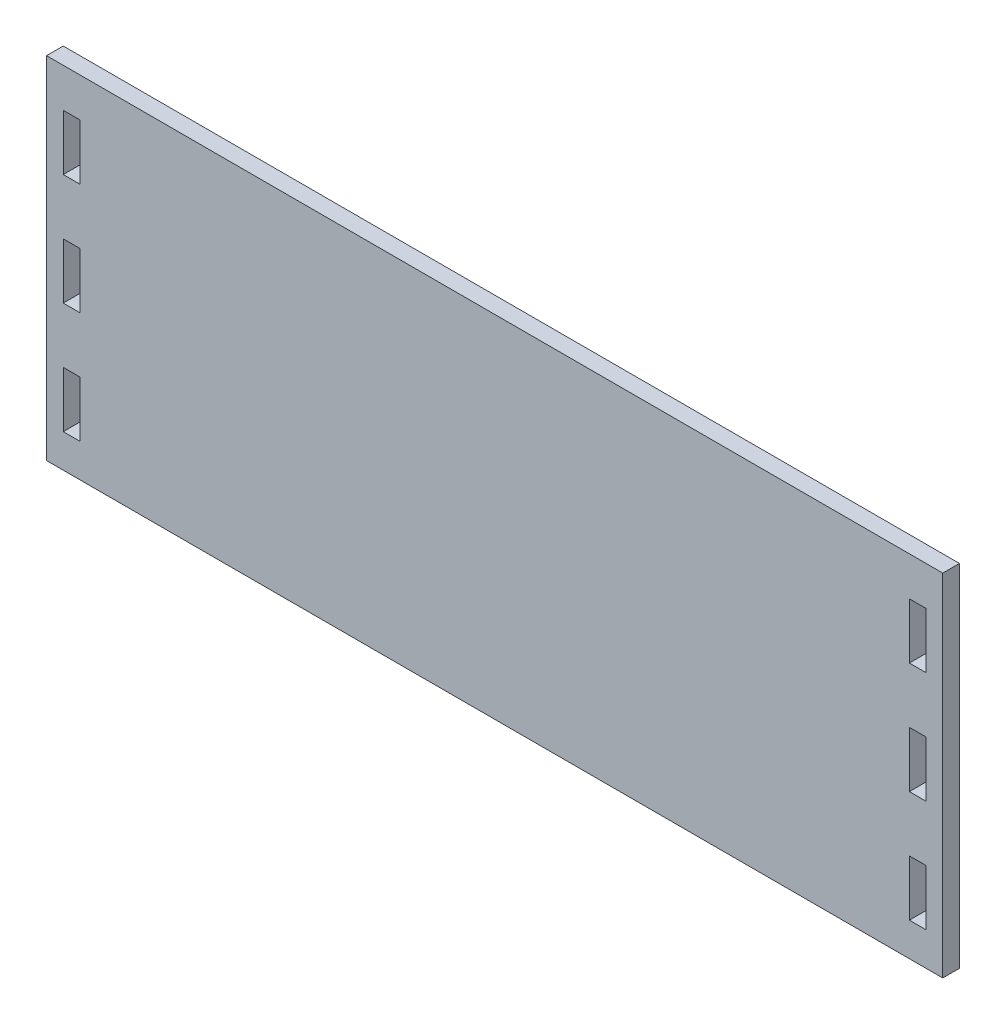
ISO-10303-21;
HEADER;
FILE_DESCRIPTION(('STEP AP214'),'2;1');
FILE_NAME('part.step','',(''),(''),'','','');
FILE_SCHEMA(('AUTOMOTIVE_DESIGN { 1 0 10303 214 1 1 1 1 }'));
ENDSEC;
DATA;
#1=APPLICATION_CONTEXT('core data for automotive mechanical design processes');
#2=APPLICATION_PROTOCOL_DEFINITION('international standard','automotive_design',2000,#1);
#3=PRODUCT_CONTEXT('',#1,'mechanical');
#4=PRODUCT('Part','Part','',(#3));
#5=PRODUCT_RELATED_PRODUCT_CATEGORY('part','',(#4));
#6=PRODUCT_DEFINITION_FORMATION('','',#4);
#7=PRODUCT_DEFINITION_CONTEXT('part definition',#1,'design');
#8=PRODUCT_DEFINITION('design','',#6,#7);
#9=PRODUCT_DEFINITION_SHAPE('','',#8);
#10=(LENGTH_UNIT() NAMED_UNIT(*) SI_UNIT(.MILLI.,.METRE.));
#11=(NAMED_UNIT(*) PLANE_ANGLE_UNIT() SI_UNIT($,.RADIAN.));
#12=(NAMED_UNIT(*) SI_UNIT($,.STERADIAN.) SOLID_ANGLE_UNIT());
#13=UNCERTAINTY_MEASURE_WITH_UNIT(LENGTH_MEASURE(1.E-05),#10,'distance_accuracy_value','');
#14=(GEOMETRIC_REPRESENTATION_CONTEXT(3) GLOBAL_UNCERTAINTY_ASSIGNED_CONTEXT((#13)) GLOBAL_UNIT_ASSIGNED_CONTEXT((#10,
#11,#12)) REPRESENTATION_CONTEXT('',''));
#15=CARTESIAN_POINT('',(0.,0.,0.));
#16=DIRECTION('',(0.,0.,1.));
#17=DIRECTION('',(1.,0.,0.));
#18=AXIS2_PLACEMENT_3D('',#15,#16,#17);
#19=CARTESIAN_POINT('',(0.,0.,3.));
#20=DIRECTION('',(0.,0.,1.));
#21=DIRECTION('',(1.,0.,0.));
#22=AXIS2_PLACEMENT_3D('',#19,#20,#21);
#23=PLANE('',#22);
#24=DIRECTION('',(0.,1.,0.));
#25=VECTOR('',#24,1.);
#26=CARTESIAN_POINT('',(80.5,31.5,3.));
#27=LINE('',#26,#25);
#28=CARTESIAN_POINT('',(80.5,-31.5,3.));
#29=VERTEX_POINT('',#28);
#30=CARTESIAN_POINT('',(80.5,31.5,3.));
#31=VERTEX_POINT('',#30);
#32=EDGE_CURVE('E409',#29,#31,#27,.T.);
#33=ORIENTED_EDGE('',*,*,#32,.T.);
#34=DIRECTION('',(-1.,0.,0.));
#35=VECTOR('',#34,1.);
#36=CARTESIAN_POINT('',(-80.5,31.5,3.));
#37=LINE('',#36,#35);
#38=CARTESIAN_POINT('',(-80.5,31.5,3.));
#39=VERTEX_POINT('',#38);
#40=EDGE_CURVE('E412',#31,#39,#37,.T.);
#41=ORIENTED_EDGE('',*,*,#40,.T.);
#42=DIRECTION('',(0.,-1.,0.));
#43=VECTOR('',#42,1.);
#44=CARTESIAN_POINT('',(-80.5,31.5,3.));
#45=LINE('',#44,#43);
#46=CARTESIAN_POINT('',(-80.5,-31.5,3.));
#47=VERTEX_POINT('',#46);
#48=EDGE_CURVE('E415',#39,#47,#45,.T.);
#49=ORIENTED_EDGE('',*,*,#48,.T.);
#50=DIRECTION('',(1.,0.,0.));
#51=VECTOR('',#50,1.);
#52=CARTESIAN_POINT('',(-80.5,-31.5,3.));
#53=LINE('',#52,#51);
#54=EDGE_CURVE('E417',#47,#29,#53,.T.);
#55=ORIENTED_EDGE('',*,*,#54,.T.);
#56=EDGE_LOOP('',(#33,#41,#49,#55));
#57=FACE_BOUND('',#56,.T.);
#58=DIRECTION('',(1.,0.,0.));
#59=VECTOR('',#58,1.);
#60=CARTESIAN_POINT('',(77.5000000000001,-25.5,3.));
#61=LINE('',#60,#59);
#62=CARTESIAN_POINT('',(74.5,-25.5,3.));
#63=VERTEX_POINT('',#62);
#64=CARTESIAN_POINT('',(77.5000000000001,-25.5,3.));
#65=VERTEX_POINT('',#64);
#66=EDGE_CURVE('E380',#63,#65,#61,.T.);
#67=ORIENTED_EDGE('',*,*,#66,.F.);
#68=DIRECTION('',(0.,-1.,0.));
#69=VECTOR('',#68,1.);
#70=CARTESIAN_POINT('',(74.5,-25.5,3.));
#71=LINE('',#70,#69);
#72=CARTESIAN_POINT('',(74.5,-15.5,3.));
#73=VERTEX_POINT('',#72);
#74=EDGE_CURVE('E378',#73,#63,#71,.T.);
#75=ORIENTED_EDGE('',*,*,#74,.F.);
#76=DIRECTION('',(-1.,0.,0.));
#77=VECTOR('',#76,1.);
#78=CARTESIAN_POINT('',(77.5,-15.5,3.));
#79=LINE('',#78,#77);
#80=CARTESIAN_POINT('',(77.5,-15.5,3.));
#81=VERTEX_POINT('',#80);
#82=EDGE_CURVE('E386',#81,#73,#79,.T.);
#83=ORIENTED_EDGE('',*,*,#82,.F.);
#84=DIRECTION('',(0.,1.,0.));
#85=VECTOR('',#84,1.);
#86=CARTESIAN_POINT('',(77.5000000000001,-25.5,3.));
#87=LINE('',#86,#85);
#88=EDGE_CURVE('E383',#65,#81,#87,.T.);
#89=ORIENTED_EDGE('',*,*,#88,.F.);
#90=EDGE_LOOP('',(#67,#75,#83,#89));
#91=FACE_BOUND('',#90,.T.);
#92=DIRECTION('',(-1.,0.,0.));
#93=VECTOR('',#92,1.);
#94=CARTESIAN_POINT('',(-77.5,-15.5,3.));
#95=LINE('',#94,#93);
#96=CARTESIAN_POINT('',(-74.5,-15.5,3.));
#97=VERTEX_POINT('',#96);
#98=CARTESIAN_POINT('',(-77.5,-15.5,3.));
#99=VERTEX_POINT('',#98);
#100=EDGE_CURVE('E349',#97,#99,#95,.T.);
#101=ORIENTED_EDGE('',*,*,#100,.F.);
#102=DIRECTION('',(0.,1.,0.));
#103=VECTOR('',#102,1.);
#104=CARTESIAN_POINT('',(-74.5,-25.5,3.));
#105=LINE('',#104,#103);
#106=CARTESIAN_POINT('',(-74.5,-25.5,3.));
#107=VERTEX_POINT('',#106);
#108=EDGE_CURVE('E347',#107,#97,#105,.T.);
#109=ORIENTED_EDGE('',*,*,#108,.F.);
#110=DIRECTION('',(1.,0.,0.));
#111=VECTOR('',#110,1.);
#112=CARTESIAN_POINT('',(-77.5,-25.5,3.));
#113=LINE('',#112,#111);
#114=CARTESIAN_POINT('',(-77.5,-25.5,3.));
#115=VERTEX_POINT('',#114);
#116=EDGE_CURVE('E355',#115,#107,#113,.T.);
#117=ORIENTED_EDGE('',*,*,#116,.F.);
#118=DIRECTION('',(0.,-1.,0.));
#119=VECTOR('',#118,1.);
#120=CARTESIAN_POINT('',(-77.5,-25.5,3.));
#121=LINE('',#120,#119);
#122=EDGE_CURVE('E352',#99,#115,#121,.T.);
#123=ORIENTED_EDGE('',*,*,#122,.F.);
#124=EDGE_LOOP('',(#101,#109,#117,#123));
#125=FACE_BOUND('',#124,.T.);
#126=DIRECTION('',(1.,0.,0.));
#127=VECTOR('',#126,1.);
#128=CARTESIAN_POINT('',(77.5,-5.5,3.));
#129=LINE('',#128,#127);
#130=CARTESIAN_POINT('',(74.5,-5.5,3.));
#131=VERTEX_POINT('',#130);
#132=CARTESIAN_POINT('',(77.5,-5.5,3.));
#133=VERTEX_POINT('',#132);
#134=EDGE_CURVE('E318',#131,#133,#129,.T.);
#135=ORIENTED_EDGE('',*,*,#134,.F.);
#136=DIRECTION('',(0.,-1.,0.));
#137=VECTOR('',#136,1.);
#138=CARTESIAN_POINT('',(74.5,-5.5,3.));
#139=LINE('',#138,#137);
#140=CARTESIAN_POINT('',(74.5,4.5,3.));
#141=VERTEX_POINT('',#140);
#142=EDGE_CURVE('E316',#141,#131,#139,.T.);
#143=ORIENTED_EDGE('',*,*,#142,.F.);
#144=DIRECTION('',(-1.,0.,0.));
#145=VECTOR('',#144,1.);
#146=CARTESIAN_POINT('',(77.5,4.5,3.));
#147=LINE('',#146,#145);
#148=CARTESIAN_POINT('',(77.5,4.5,3.));
#149=VERTEX_POINT('',#148);
#150=EDGE_CURVE('E324',#149,#141,#147,.T.);
#151=ORIENTED_EDGE('',*,*,#150,.F.);
#152=DIRECTION('',(0.,1.,0.));
#153=VECTOR('',#152,1.);
#154=CARTESIAN_POINT('',(77.5,-5.5,3.));
#155=LINE('',#154,#153);
#156=EDGE_CURVE('E321',#133,#149,#155,.T.);
#157=ORIENTED_EDGE('',*,*,#156,.F.);
#158=EDGE_LOOP('',(#135,#143,#151,#157));
#159=FACE_BOUND('',#158,.T.);
#160=DIRECTION('',(1.,0.,0.));
#161=VECTOR('',#160,1.);
#162=CARTESIAN_POINT('',(77.4999999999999,14.5,3.));
#163=LINE('',#162,#161);
#164=CARTESIAN_POINT('',(74.4999999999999,14.5,3.));
#165=VERTEX_POINT('',#164);
#166=CARTESIAN_POINT('',(77.4999999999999,14.5,3.));
#167=VERTEX_POINT('',#166);
#168=EDGE_CURVE('E287',#165,#167,#163,.T.);
#169=ORIENTED_EDGE('',*,*,#168,.F.);
#170=DIRECTION('',(0.,-1.,0.));
#171=VECTOR('',#170,1.);
#172=CARTESIAN_POINT('',(74.4999999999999,14.5,3.));
#173=LINE('',#172,#171);
#174=CARTESIAN_POINT('',(74.4999999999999,24.5,3.));
#175=VERTEX_POINT('',#174);
#176=EDGE_CURVE('E285',#175,#165,#173,.T.);
#177=ORIENTED_EDGE('',*,*,#176,.F.);
#178=DIRECTION('',(-1.,0.,0.));
#179=VECTOR('',#178,1.);
#180=CARTESIAN_POINT('',(77.4999999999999,24.5,3.));
#181=LINE('',#180,#179);
#182=CARTESIAN_POINT('',(77.4999999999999,24.5,3.));
#183=VERTEX_POINT('',#182);
#184=EDGE_CURVE('E293',#183,#175,#181,.T.);
#185=ORIENTED_EDGE('',*,*,#184,.F.);
#186=DIRECTION('',(0.,1.,0.));
#187=VECTOR('',#186,1.);
#188=CARTESIAN_POINT('',(77.4999999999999,14.5,3.));
#189=LINE('',#188,#187);
#190=EDGE_CURVE('E290',#167,#183,#189,.T.);
#191=ORIENTED_EDGE('',*,*,#190,.F.);
#192=EDGE_LOOP('',(#169,#177,#185,#191));
#193=FACE_BOUND('',#192,.T.);
#194=DIRECTION('',(-1.,0.,0.));
#195=VECTOR('',#194,1.);
#196=CARTESIAN_POINT('',(-77.5,4.5,3.));
#197=LINE('',#196,#195);
#198=CARTESIAN_POINT('',(-74.5,4.5,3.));
#199=VERTEX_POINT('',#198);
#200=CARTESIAN_POINT('',(-77.5,4.5,3.));
#201=VERTEX_POINT('',#200);
#202=EDGE_CURVE('E256',#199,#201,#197,.T.);
#203=ORIENTED_EDGE('',*,*,#202,.F.);
#204=DIRECTION('',(0.,1.,0.));
#205=VECTOR('',#204,1.);
#206=CARTESIAN_POINT('',(-74.5,-5.5,3.));
#207=LINE('',#206,#205);
#208=CARTESIAN_POINT('',(-74.5,-5.5,3.));
#209=VERTEX_POINT('',#208);
#210=EDGE_CURVE('E254',#209,#199,#207,.T.);
#211=ORIENTED_EDGE('',*,*,#210,.F.);
#212=DIRECTION('',(1.,0.,0.));
#213=VECTOR('',#212,1.);
#214=CARTESIAN_POINT('',(-77.5,-5.5,3.));
#215=LINE('',#214,#213);
#216=CARTESIAN_POINT('',(-77.5,-5.5,3.));
#217=VERTEX_POINT('',#216);
#218=EDGE_CURVE('E262',#217,#209,#215,.T.);
#219=ORIENTED_EDGE('',*,*,#218,.F.);
#220=DIRECTION('',(0.,-1.,0.));
#221=VECTOR('',#220,1.);
#222=CARTESIAN_POINT('',(-77.5,-5.5,3.));
#223=LINE('',#222,#221);
#224=EDGE_CURVE('E259',#201,#217,#223,.T.);
#225=ORIENTED_EDGE('',*,*,#224,.F.);
#226=EDGE_LOOP('',(#203,#211,#219,#225));
#227=FACE_BOUND('',#226,.T.);
#228=DIRECTION('',(-1.,0.,0.));
#229=VECTOR('',#228,1.);
#230=CARTESIAN_POINT('',(-77.5000000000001,24.5,3.));
#231=LINE('',#230,#229);
#232=CARTESIAN_POINT('',(-74.5000000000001,24.5,3.));
#233=VERTEX_POINT('',#232);
#234=CARTESIAN_POINT('',(-77.5000000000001,24.5,3.));
#235=VERTEX_POINT('',#234);
#236=EDGE_CURVE('E226',#233,#235,#231,.T.);
#237=ORIENTED_EDGE('',*,*,#236,.F.);
#238=DIRECTION('',(0.,1.,0.));
#239=VECTOR('',#238,1.);
#240=CARTESIAN_POINT('',(-74.5000000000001,14.5,3.));
#241=LINE('',#240,#239);
#242=CARTESIAN_POINT('',(-74.5000000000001,14.5,3.));
#243=VERTEX_POINT('',#242);
#244=EDGE_CURVE('E218',#243,#233,#241,.T.);
#245=ORIENTED_EDGE('',*,*,#244,.F.);
#246=DIRECTION('',(1.,0.,0.));
#247=VECTOR('',#246,1.);
#248=CARTESIAN_POINT('',(-77.5000000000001,14.5,3.));
#249=LINE('',#248,#247);
#250=CARTESIAN_POINT('',(-77.5000000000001,14.5,3.));
#251=VERTEX_POINT('',#250);
#252=EDGE_CURVE('E240',#251,#243,#249,.T.);
#253=ORIENTED_EDGE('',*,*,#252,.F.);
#254=DIRECTION('',(0.,-1.,0.));
#255=VECTOR('',#254,1.);
#256=CARTESIAN_POINT('',(-77.5000000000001,14.5,3.));
#257=LINE('',#256,#255);
#258=EDGE_CURVE('E238',#235,#251,#257,.T.);
#259=ORIENTED_EDGE('',*,*,#258,.F.);
#260=EDGE_LOOP('',(#237,#245,#253,#259));
#261=FACE_BOUND('',#260,.T.);
#262=ADVANCED_FACE('F33',(#57,#91,#125,#159,#193,#227,#261),#23,.T.);
#263=CARTESIAN_POINT('',(0.,0.,0.));
#264=DIRECTION('',(0.,0.,1.));
#265=DIRECTION('',(1.,0.,0.));
#266=AXIS2_PLACEMENT_3D('',#263,#264,#265);
#267=PLANE('',#266);
#268=DIRECTION('',(0.,1.,0.));
#269=VECTOR('',#268,1.);
#270=CARTESIAN_POINT('',(-74.5,-5.5,0.));
#271=LINE('',#270,#269);
#272=CARTESIAN_POINT('',(-74.5,-5.5,0.));
#273=VERTEX_POINT('',#272);
#274=CARTESIAN_POINT('',(-74.5,4.5,0.));
#275=VERTEX_POINT('',#274);
#276=EDGE_CURVE('E234',#273,#275,#271,.T.);
#277=ORIENTED_EDGE('',*,*,#276,.T.);
#278=DIRECTION('',(-1.,0.,0.));
#279=VECTOR('',#278,1.);
#280=CARTESIAN_POINT('',(-77.5,4.5,0.));
#281=LINE('',#280,#279);
#282=CARTESIAN_POINT('',(-77.5,4.5,0.));
#283=VERTEX_POINT('',#282);
#284=EDGE_CURVE('E267',#275,#283,#281,.T.);
#285=ORIENTED_EDGE('',*,*,#284,.T.);
#286=DIRECTION('',(0.,-1.,0.));
#287=VECTOR('',#286,1.);
#288=CARTESIAN_POINT('',(-77.5,-5.5,0.));
#289=LINE('',#288,#287);
#290=CARTESIAN_POINT('',(-77.5,-5.5,0.));
#291=VERTEX_POINT('',#290);
#292=EDGE_CURVE('E270',#283,#291,#289,.T.);
#293=ORIENTED_EDGE('',*,*,#292,.T.);
#294=DIRECTION('',(1.,0.,0.));
#295=VECTOR('',#294,1.);
#296=CARTESIAN_POINT('',(-77.5,-5.5,0.));
#297=LINE('',#296,#295);
#298=EDGE_CURVE('E257',#291,#273,#297,.T.);
#299=ORIENTED_EDGE('',*,*,#298,.T.);
#300=EDGE_LOOP('',(#277,#285,#293,#299));
#301=FACE_BOUND('',#300,.T.);
#302=DIRECTION('',(0.,-1.,0.));
#303=VECTOR('',#302,1.);
#304=CARTESIAN_POINT('',(74.5,-5.5,0.));
#305=LINE('',#304,#303);
#306=CARTESIAN_POINT('',(74.5,4.5,0.));
#307=VERTEX_POINT('',#306);
#308=CARTESIAN_POINT('',(74.5,-5.5,0.));
#309=VERTEX_POINT('',#308);
#310=EDGE_CURVE('E315',#307,#309,#305,.T.);
#311=ORIENTED_EDGE('',*,*,#310,.T.);
#312=DIRECTION('',(1.,0.,0.));
#313=VECTOR('',#312,1.);
#314=CARTESIAN_POINT('',(77.5,-5.5,0.));
#315=LINE('',#314,#313);
#316=CARTESIAN_POINT('',(77.5,-5.5,0.));
#317=VERTEX_POINT('',#316);
#318=EDGE_CURVE('E329',#309,#317,#315,.T.);
#319=ORIENTED_EDGE('',*,*,#318,.T.);
#320=DIRECTION('',(0.,1.,0.));
#321=VECTOR('',#320,1.);
#322=CARTESIAN_POINT('',(77.5,-5.5,0.));
#323=LINE('',#322,#321);
#324=CARTESIAN_POINT('',(77.5,4.5,0.));
#325=VERTEX_POINT('',#324);
#326=EDGE_CURVE('E332',#317,#325,#323,.T.);
#327=ORIENTED_EDGE('',*,*,#326,.T.);
#328=DIRECTION('',(-1.,0.,0.));
#329=VECTOR('',#328,1.);
#330=CARTESIAN_POINT('',(77.5,4.5,0.));
#331=LINE('',#330,#329);
#332=EDGE_CURVE('E319',#325,#307,#331,.T.);
#333=ORIENTED_EDGE('',*,*,#332,.T.);
#334=EDGE_LOOP('',(#311,#319,#327,#333));
#335=FACE_BOUND('',#334,.T.);
#336=DIRECTION('',(0.,-1.,0.));
#337=VECTOR('',#336,1.);
#338=CARTESIAN_POINT('',(74.5,-25.5,0.));
#339=LINE('',#338,#337);
#340=CARTESIAN_POINT('',(74.5,-15.5,0.));
#341=VERTEX_POINT('',#340);
#342=CARTESIAN_POINT('',(74.5,-25.5,0.));
#343=VERTEX_POINT('',#342);
#344=EDGE_CURVE('E377',#341,#343,#339,.T.);
#345=ORIENTED_EDGE('',*,*,#344,.T.);
#346=DIRECTION('',(1.,0.,0.));
#347=VECTOR('',#346,1.);
#348=CARTESIAN_POINT('',(77.5000000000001,-25.5,0.));
#349=LINE('',#348,#347);
#350=CARTESIAN_POINT('',(77.5000000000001,-25.5,0.));
#351=VERTEX_POINT('',#350);
#352=EDGE_CURVE('E391',#343,#351,#349,.T.);
#353=ORIENTED_EDGE('',*,*,#352,.T.);
#354=DIRECTION('',(0.,1.,0.));
#355=VECTOR('',#354,1.);
#356=CARTESIAN_POINT('',(77.5000000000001,-25.5,0.));
#357=LINE('',#356,#355);
#358=CARTESIAN_POINT('',(77.5,-15.5,0.));
#359=VERTEX_POINT('',#358);
#360=EDGE_CURVE('E394',#351,#359,#357,.T.);
#361=ORIENTED_EDGE('',*,*,#360,.T.);
#362=DIRECTION('',(-1.,0.,0.));
#363=VECTOR('',#362,1.);
#364=CARTESIAN_POINT('',(77.5,-15.5,0.));
#365=LINE('',#364,#363);
#366=EDGE_CURVE('E381',#359,#341,#365,.T.);
#367=ORIENTED_EDGE('',*,*,#366,.T.);
#368=EDGE_LOOP('',(#345,#353,#361,#367));
#369=FACE_BOUND('',#368,.T.);
#370=DIRECTION('',(0.,1.,0.));
#371=VECTOR('',#370,1.);
#372=CARTESIAN_POINT('',(80.5,31.5,0.));
#373=LINE('',#372,#371);
#374=CARTESIAN_POINT('',(80.5,-31.5,0.));
#375=VERTEX_POINT('',#374);
#376=CARTESIAN_POINT('',(80.5,31.5,0.));
#377=VERTEX_POINT('',#376);
#378=EDGE_CURVE('E408',#375,#377,#373,.T.);
#379=ORIENTED_EDGE('',*,*,#378,.F.);
#380=DIRECTION('',(1.,0.,0.));
#381=VECTOR('',#380,1.);
#382=CARTESIAN_POINT('',(-80.5,-31.5,0.));
#383=LINE('',#382,#381);
#384=CARTESIAN_POINT('',(-80.5,-31.5,0.));
#385=VERTEX_POINT('',#384);
#386=EDGE_CURVE('E413',#385,#375,#383,.T.);
#387=ORIENTED_EDGE('',*,*,#386,.F.);
#388=DIRECTION('',(0.,-1.,0.));
#389=VECTOR('',#388,1.);
#390=CARTESIAN_POINT('',(-80.5,31.5,0.));
#391=LINE('',#390,#389);
#392=CARTESIAN_POINT('',(-80.5,31.5,0.));
#393=VERTEX_POINT('',#392);
#394=EDGE_CURVE('E424',#393,#385,#391,.T.);
#395=ORIENTED_EDGE('',*,*,#394,.F.);
#396=DIRECTION('',(-1.,0.,0.));
#397=VECTOR('',#396,1.);
#398=CARTESIAN_POINT('',(-80.5,31.5,0.));
#399=LINE('',#398,#397);
#400=EDGE_CURVE('E422',#377,#393,#399,.T.);
#401=ORIENTED_EDGE('',*,*,#400,.F.);
#402=EDGE_LOOP('',(#379,#387,#395,#401));
#403=FACE_BOUND('',#402,.T.);
#404=DIRECTION('',(0.,1.,0.));
#405=VECTOR('',#404,1.);
#406=CARTESIAN_POINT('',(-74.5,-25.5,0.));
#407=LINE('',#406,#405);
#408=CARTESIAN_POINT('',(-74.5,-25.5,0.));
#409=VERTEX_POINT('',#408);
#410=CARTESIAN_POINT('',(-74.5,-15.5,0.));
#411=VERTEX_POINT('',#410);
#412=EDGE_CURVE('E346',#409,#411,#407,.T.);
#413=ORIENTED_EDGE('',*,*,#412,.T.);
#414=DIRECTION('',(-1.,0.,0.));
#415=VECTOR('',#414,1.);
#416=CARTESIAN_POINT('',(-77.5,-15.5,0.));
#417=LINE('',#416,#415);
#418=CARTESIAN_POINT('',(-77.5,-15.5,0.));
#419=VERTEX_POINT('',#418);
#420=EDGE_CURVE('E360',#411,#419,#417,.T.);
#421=ORIENTED_EDGE('',*,*,#420,.T.);
#422=DIRECTION('',(0.,-1.,0.));
#423=VECTOR('',#422,1.);
#424=CARTESIAN_POINT('',(-77.5,-25.5,0.));
#425=LINE('',#424,#423);
#426=CARTESIAN_POINT('',(-77.5,-25.5,0.));
#427=VERTEX_POINT('',#426);
#428=EDGE_CURVE('E363',#419,#427,#425,.T.);
#429=ORIENTED_EDGE('',*,*,#428,.T.);
#430=DIRECTION('',(1.,0.,0.));
#431=VECTOR('',#430,1.);
#432=CARTESIAN_POINT('',(-77.5,-25.5,0.));
#433=LINE('',#432,#431);
#434=EDGE_CURVE('E350',#427,#409,#433,.T.);
#435=ORIENTED_EDGE('',*,*,#434,.T.);
#436=EDGE_LOOP('',(#413,#421,#429,#435));
#437=FACE_BOUND('',#436,.T.);
#438=DIRECTION('',(0.,-1.,0.));
#439=VECTOR('',#438,1.);
#440=CARTESIAN_POINT('',(74.4999999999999,14.5,0.));
#441=LINE('',#440,#439);
#442=CARTESIAN_POINT('',(74.4999999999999,24.5,0.));
#443=VERTEX_POINT('',#442);
#444=CARTESIAN_POINT('',(74.4999999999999,14.5,0.));
#445=VERTEX_POINT('',#444);
#446=EDGE_CURVE('E284',#443,#445,#441,.T.);
#447=ORIENTED_EDGE('',*,*,#446,.T.);
#448=DIRECTION('',(1.,0.,0.));
#449=VECTOR('',#448,1.);
#450=CARTESIAN_POINT('',(77.4999999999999,14.5,0.));
#451=LINE('',#450,#449);
#452=CARTESIAN_POINT('',(77.4999999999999,14.5,0.));
#453=VERTEX_POINT('',#452);
#454=EDGE_CURVE('E298',#445,#453,#451,.T.);
#455=ORIENTED_EDGE('',*,*,#454,.T.);
#456=DIRECTION('',(0.,1.,0.));
#457=VECTOR('',#456,1.);
#458=CARTESIAN_POINT('',(77.4999999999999,14.5,0.));
#459=LINE('',#458,#457);
#460=CARTESIAN_POINT('',(77.4999999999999,24.5,0.));
#461=VERTEX_POINT('',#460);
#462=EDGE_CURVE('E301',#453,#461,#459,.T.);
#463=ORIENTED_EDGE('',*,*,#462,.T.);
#464=DIRECTION('',(-1.,0.,0.));
#465=VECTOR('',#464,1.);
#466=CARTESIAN_POINT('',(77.4999999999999,24.5,0.));
#467=LINE('',#466,#465);
#468=EDGE_CURVE('E288',#461,#443,#467,.T.);
#469=ORIENTED_EDGE('',*,*,#468,.T.);
#470=EDGE_LOOP('',(#447,#455,#463,#469));
#471=FACE_BOUND('',#470,.T.);
#472=DIRECTION('',(0.,1.,0.));
#473=VECTOR('',#472,1.);
#474=CARTESIAN_POINT('',(-74.5000000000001,14.5,0.));
#475=LINE('',#474,#473);
#476=CARTESIAN_POINT('',(-74.5000000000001,14.5,0.));
#477=VERTEX_POINT('',#476);
#478=CARTESIAN_POINT('',(-74.5000000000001,24.5,0.));
#479=VERTEX_POINT('',#478);
#480=EDGE_CURVE('E56',#477,#479,#475,.T.);
#481=ORIENTED_EDGE('',*,*,#480,.T.);
#482=DIRECTION('',(-1.,0.,0.));
#483=VECTOR('',#482,1.);
#484=CARTESIAN_POINT('',(-77.5000000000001,24.5,0.));
#485=LINE('',#484,#483);
#486=CARTESIAN_POINT('',(-77.5000000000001,24.5,0.));
#487=VERTEX_POINT('',#486);
#488=EDGE_CURVE('E233',#479,#487,#485,.T.);
#489=ORIENTED_EDGE('',*,*,#488,.T.);
#490=DIRECTION('',(0.,-1.,0.));
#491=VECTOR('',#490,1.);
#492=CARTESIAN_POINT('',(-77.5000000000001,14.5,0.));
#493=LINE('',#492,#491);
#494=CARTESIAN_POINT('',(-77.5000000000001,14.5,0.));
#495=VERTEX_POINT('',#494);
#496=EDGE_CURVE('E246',#487,#495,#493,.T.);
#497=ORIENTED_EDGE('',*,*,#496,.T.);
#498=DIRECTION('',(1.,0.,0.));
#499=VECTOR('',#498,1.);
#500=CARTESIAN_POINT('',(-77.5000000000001,14.5,0.));
#501=LINE('',#500,#499);
#502=EDGE_CURVE('E227',#495,#477,#501,.T.);
#503=ORIENTED_EDGE('',*,*,#502,.T.);
#504=EDGE_LOOP('',(#481,#489,#497,#503));
#505=FACE_BOUND('',#504,.T.);
#506=ADVANCED_FACE('F442',(#301,#335,#369,#403,#437,#471,#505),#267,.F.);
#507=CARTESIAN_POINT('',(80.5,31.5,3.));
#508=DIRECTION('',(-1.,0.,0.));
#509=DIRECTION('',(0.,0.,1.));
#510=AXIS2_PLACEMENT_3D('',#507,#508,#509);
#511=PLANE('',#510);
#512=ORIENTED_EDGE('',*,*,#378,.T.);
#513=DIRECTION('',(0.,0.,-1.));
#514=VECTOR('',#513,1.);
#515=CARTESIAN_POINT('',(80.5,31.5,3.));
#516=LINE('',#515,#514);
#517=EDGE_CURVE('E11',#31,#377,#516,.T.);
#518=ORIENTED_EDGE('',*,*,#517,.F.);
#519=ORIENTED_EDGE('',*,*,#32,.F.);
#520=DIRECTION('',(0.,0.,-1.));
#521=VECTOR('',#520,1.);
#522=CARTESIAN_POINT('',(80.5,-31.5,3.));
#523=LINE('',#522,#521);
#524=EDGE_CURVE('E419',#29,#375,#523,.T.);
#525=ORIENTED_EDGE('',*,*,#524,.T.);
#526=EDGE_LOOP('',(#512,#518,#519,#525));
#527=FACE_BOUND('',#526,.T.);
#528=ADVANCED_FACE('F35',(#527),#511,.F.);
#529=CARTESIAN_POINT('',(-80.5,31.5,3.));
#530=DIRECTION('',(0.,-1.,0.));
#531=DIRECTION('',(0.,0.,-1.));
#532=AXIS2_PLACEMENT_3D('',#529,#530,#531);
#533=PLANE('',#532);
#534=ORIENTED_EDGE('',*,*,#400,.T.);
#535=DIRECTION('',(0.,0.,-1.));
#536=VECTOR('',#535,1.);
#537=CARTESIAN_POINT('',(-80.5,31.5,3.));
#538=LINE('',#537,#536);
#539=EDGE_CURVE('E41',#39,#393,#538,.T.);
#540=ORIENTED_EDGE('',*,*,#539,.F.);
#541=ORIENTED_EDGE('',*,*,#40,.F.);
#542=ORIENTED_EDGE('',*,*,#517,.T.);
#543=EDGE_LOOP('',(#534,#540,#541,#542));
#544=FACE_BOUND('',#543,.T.);
#545=ADVANCED_FACE('F453',(#544),#533,.F.);
#546=CARTESIAN_POINT('',(-80.5,31.5,3.));
#547=DIRECTION('',(1.,0.,0.));
#548=DIRECTION('',(0.,1.,0.));
#549=AXIS2_PLACEMENT_3D('',#546,#547,#548);
#550=PLANE('',#549);
#551=ORIENTED_EDGE('',*,*,#394,.T.);
#552=DIRECTION('',(0.,0.,-1.));
#553=VECTOR('',#552,1.);
#554=CARTESIAN_POINT('',(-80.5,-31.5,3.));
#555=LINE('',#554,#553);
#556=EDGE_CURVE('E429',#47,#385,#555,.T.);
#557=ORIENTED_EDGE('',*,*,#556,.F.);
#558=ORIENTED_EDGE('',*,*,#48,.F.);
#559=ORIENTED_EDGE('',*,*,#539,.T.);
#560=EDGE_LOOP('',(#551,#557,#558,#559));
#561=FACE_BOUND('',#560,.T.);
#562=ADVANCED_FACE('F436',(#561),#550,.F.);
#563=CARTESIAN_POINT('',(-80.5,-31.5,3.));
#564=DIRECTION('',(0.,1.,0.));
#565=DIRECTION('',(0.,0.,1.));
#566=AXIS2_PLACEMENT_3D('',#563,#564,#565);
#567=PLANE('',#566);
#568=ORIENTED_EDGE('',*,*,#386,.T.);
#569=ORIENTED_EDGE('',*,*,#524,.F.);
#570=ORIENTED_EDGE('',*,*,#54,.F.);
#571=ORIENTED_EDGE('',*,*,#556,.T.);
#572=EDGE_LOOP('',(#568,#569,#570,#571));
#573=FACE_BOUND('',#572,.T.);
#574=ADVANCED_FACE('F446',(#573),#567,.F.);
#575=CARTESIAN_POINT('',(74.5,-25.5,3.));
#576=DIRECTION('',(1.,0.,0.));
#577=DIRECTION('',(0.,0.,-1.));
#578=AXIS2_PLACEMENT_3D('',#575,#576,#577);
#579=PLANE('',#578);
#580=ORIENTED_EDGE('',*,*,#344,.F.);
#581=DIRECTION('',(0.,0.,-1.));
#582=VECTOR('',#581,1.);
#583=CARTESIAN_POINT('',(74.5,-15.5,3.));
#584=LINE('',#583,#582);
#585=EDGE_CURVE('E388',#73,#341,#584,.T.);
#586=ORIENTED_EDGE('',*,*,#585,.F.);
#587=ORIENTED_EDGE('',*,*,#74,.T.);
#588=DIRECTION('',(0.,0.,-1.));
#589=VECTOR('',#588,1.);
#590=CARTESIAN_POINT('',(74.5,-25.5,3.));
#591=LINE('',#590,#589);
#592=EDGE_CURVE('E405',#63,#343,#591,.T.);
#593=ORIENTED_EDGE('',*,*,#592,.T.);
#594=EDGE_LOOP('',(#580,#586,#587,#593));
#595=FACE_BOUND('',#594,.T.);
#596=ADVANCED_FACE('F468',(#595),#579,.T.);
#597=CARTESIAN_POINT('',(77.5000000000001,-25.5,3.));
#598=DIRECTION('',(0.,1.,0.));
#599=DIRECTION('',(0.,0.,1.));
#600=AXIS2_PLACEMENT_3D('',#597,#598,#599);
#601=PLANE('',#600);
#602=ORIENTED_EDGE('',*,*,#352,.F.);
#603=ORIENTED_EDGE('',*,*,#592,.F.);
#604=ORIENTED_EDGE('',*,*,#66,.T.);
#605=DIRECTION('',(0.,0.,-1.));
#606=VECTOR('',#605,1.);
#607=CARTESIAN_POINT('',(77.5000000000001,-25.5,3.));
#608=LINE('',#607,#606);
#609=EDGE_CURVE('E403',#65,#351,#608,.T.);
#610=ORIENTED_EDGE('',*,*,#609,.T.);
#611=EDGE_LOOP('',(#602,#603,#604,#610));
#612=FACE_BOUND('',#611,.T.);
#613=ADVANCED_FACE('F475',(#612),#601,.T.);
#614=CARTESIAN_POINT('',(77.5000000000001,-25.5,3.));
#615=DIRECTION('',(-1.,0.,0.));
#616=DIRECTION('',(0.,-1.,0.));
#617=AXIS2_PLACEMENT_3D('',#614,#615,#616);
#618=PLANE('',#617);
#619=ORIENTED_EDGE('',*,*,#360,.F.);
#620=ORIENTED_EDGE('',*,*,#609,.F.);
#621=ORIENTED_EDGE('',*,*,#88,.T.);
#622=DIRECTION('',(0.,0.,-1.));
#623=VECTOR('',#622,1.);
#624=CARTESIAN_POINT('',(77.5,-15.5,3.));
#625=LINE('',#624,#623);
#626=EDGE_CURVE('E401',#81,#359,#625,.T.);
#627=ORIENTED_EDGE('',*,*,#626,.T.);
#628=EDGE_LOOP('',(#619,#620,#621,#627));
#629=FACE_BOUND('',#628,.T.);
#630=ADVANCED_FACE('F480',(#629),#618,.T.);
#631=CARTESIAN_POINT('',(77.5,-15.5,3.));
#632=DIRECTION('',(0.,-1.,0.));
#633=DIRECTION('',(1.,0.,0.));
#634=AXIS2_PLACEMENT_3D('',#631,#632,#633);
#635=PLANE('',#634);
#636=ORIENTED_EDGE('',*,*,#366,.F.);
#637=ORIENTED_EDGE('',*,*,#626,.F.);
#638=ORIENTED_EDGE('',*,*,#82,.T.);
#639=ORIENTED_EDGE('',*,*,#585,.T.);
#640=EDGE_LOOP('',(#636,#637,#638,#639));
#641=FACE_BOUND('',#640,.T.);
#642=ADVANCED_FACE('F488',(#641),#635,.T.);
#643=CARTESIAN_POINT('',(-74.5,-25.5,3.));
#644=DIRECTION('',(-1.,0.,0.));
#645=DIRECTION('',(0.,0.,1.));
#646=AXIS2_PLACEMENT_3D('',#643,#644,#645);
#647=PLANE('',#646);
#648=ORIENTED_EDGE('',*,*,#412,.F.);
#649=DIRECTION('',(0.,0.,-1.));
#650=VECTOR('',#649,1.);
#651=CARTESIAN_POINT('',(-74.5,-25.5,3.));
#652=LINE('',#651,#650);
#653=EDGE_CURVE('E357',#107,#409,#652,.T.);
#654=ORIENTED_EDGE('',*,*,#653,.F.);
#655=ORIENTED_EDGE('',*,*,#108,.T.);
#656=DIRECTION('',(0.,0.,-1.));
#657=VECTOR('',#656,1.);
#658=CARTESIAN_POINT('',(-74.5,-15.5,3.));
#659=LINE('',#658,#657);
#660=EDGE_CURVE('E374',#97,#411,#659,.T.);
#661=ORIENTED_EDGE('',*,*,#660,.T.);
#662=EDGE_LOOP('',(#648,#654,#655,#661));
#663=FACE_BOUND('',#662,.T.);
#664=ADVANCED_FACE('F583',(#663),#647,.T.);
#665=CARTESIAN_POINT('',(-77.5,-15.5,3.));
#666=DIRECTION('',(0.,-1.,0.));
#667=DIRECTION('',(0.,0.,-1.));
#668=AXIS2_PLACEMENT_3D('',#665,#666,#667);
#669=PLANE('',#668);
#670=ORIENTED_EDGE('',*,*,#420,.F.);
#671=ORIENTED_EDGE('',*,*,#660,.F.);
#672=ORIENTED_EDGE('',*,*,#100,.T.);
#673=DIRECTION('',(0.,0.,-1.));
#674=VECTOR('',#673,1.);
#675=CARTESIAN_POINT('',(-77.5,-15.5,3.));
#676=LINE('',#675,#674);
#677=EDGE_CURVE('E372',#99,#419,#676,.T.);
#678=ORIENTED_EDGE('',*,*,#677,.T.);
#679=EDGE_LOOP('',(#670,#671,#672,#678));
#680=FACE_BOUND('',#679,.T.);
#681=ADVANCED_FACE('F579',(#680),#669,.T.);
#682=CARTESIAN_POINT('',(-77.5,-25.5,3.));
#683=DIRECTION('',(1.,0.,0.));
#684=DIRECTION('',(0.,0.,-1.));
#685=AXIS2_PLACEMENT_3D('',#682,#683,#684);
#686=PLANE('',#685);
#687=ORIENTED_EDGE('',*,*,#428,.F.);
#688=ORIENTED_EDGE('',*,*,#677,.F.);
#689=ORIENTED_EDGE('',*,*,#122,.T.);
#690=DIRECTION('',(0.,0.,-1.));
#691=VECTOR('',#690,1.);
#692=CARTESIAN_POINT('',(-77.5,-25.5,3.));
#693=LINE('',#692,#691);
#694=EDGE_CURVE('E370',#115,#427,#693,.T.);
#695=ORIENTED_EDGE('',*,*,#694,.T.);
#696=EDGE_LOOP('',(#687,#688,#689,#695));
#697=FACE_BOUND('',#696,.T.);
#698=ADVANCED_FACE('F575',(#697),#686,.T.);
#699=CARTESIAN_POINT('',(-77.5,-25.5,3.));
#700=DIRECTION('',(0.,1.,0.));
#701=DIRECTION('',(0.,0.,1.));
#702=AXIS2_PLACEMENT_3D('',#699,#700,#701);
#703=PLANE('',#702);
#704=ORIENTED_EDGE('',*,*,#434,.F.);
#705=ORIENTED_EDGE('',*,*,#694,.F.);
#706=ORIENTED_EDGE('',*,*,#116,.T.);
#707=ORIENTED_EDGE('',*,*,#653,.T.);
#708=EDGE_LOOP('',(#704,#705,#706,#707));
#709=FACE_BOUND('',#708,.T.);
#710=ADVANCED_FACE('F571',(#709),#703,.T.);
#711=CARTESIAN_POINT('',(74.5,-5.5,3.));
#712=DIRECTION('',(1.,0.,0.));
#713=DIRECTION('',(0.,0.,-1.));
#714=AXIS2_PLACEMENT_3D('',#711,#712,#713);
#715=PLANE('',#714);
#716=ORIENTED_EDGE('',*,*,#310,.F.);
#717=DIRECTION('',(0.,0.,-1.));
#718=VECTOR('',#717,1.);
#719=CARTESIAN_POINT('',(74.5,4.5,3.));
#720=LINE('',#719,#718);
#721=EDGE_CURVE('E326',#141,#307,#720,.T.);
#722=ORIENTED_EDGE('',*,*,#721,.F.);
#723=ORIENTED_EDGE('',*,*,#142,.T.);
#724=DIRECTION('',(0.,0.,-1.));
#725=VECTOR('',#724,1.);
#726=CARTESIAN_POINT('',(74.5,-5.5,3.));
#727=LINE('',#726,#725);
#728=EDGE_CURVE('E343',#131,#309,#727,.T.);
#729=ORIENTED_EDGE('',*,*,#728,.T.);
#730=EDGE_LOOP('',(#716,#722,#723,#729));
#731=FACE_BOUND('',#730,.T.);
#732=ADVANCED_FACE('F567',(#731),#715,.T.);
#733=CARTESIAN_POINT('',(77.5,-5.5,3.));
#734=DIRECTION('',(0.,1.,0.));
#735=DIRECTION('',(0.,0.,1.));
#736=AXIS2_PLACEMENT_3D('',#733,#734,#735);
#737=PLANE('',#736);
#738=ORIENTED_EDGE('',*,*,#318,.F.);
#739=ORIENTED_EDGE('',*,*,#728,.F.);
#740=ORIENTED_EDGE('',*,*,#134,.T.);
#741=DIRECTION('',(0.,0.,-1.));
#742=VECTOR('',#741,1.);
#743=CARTESIAN_POINT('',(77.5,-5.5,3.));
#744=LINE('',#743,#742);
#745=EDGE_CURVE('E341',#133,#317,#744,.T.);
#746=ORIENTED_EDGE('',*,*,#745,.T.);
#747=EDGE_LOOP('',(#738,#739,#740,#746));
#748=FACE_BOUND('',#747,.T.);
#749=ADVANCED_FACE('F563',(#748),#737,.T.);
#750=CARTESIAN_POINT('',(77.5,-5.5,3.));
#751=DIRECTION('',(-1.,0.,0.));
#752=DIRECTION('',(0.,-1.,0.));
#753=AXIS2_PLACEMENT_3D('',#750,#751,#752);
#754=PLANE('',#753);
#755=ORIENTED_EDGE('',*,*,#326,.F.);
#756=ORIENTED_EDGE('',*,*,#745,.F.);
#757=ORIENTED_EDGE('',*,*,#156,.T.);
#758=DIRECTION('',(0.,0.,-1.));
#759=VECTOR('',#758,1.);
#760=CARTESIAN_POINT('',(77.5,4.5,3.));
#761=LINE('',#760,#759);
#762=EDGE_CURVE('E339',#149,#325,#761,.T.);
#763=ORIENTED_EDGE('',*,*,#762,.T.);
#764=EDGE_LOOP('',(#755,#756,#757,#763));
#765=FACE_BOUND('',#764,.T.);
#766=ADVANCED_FACE('F559',(#765),#754,.T.);
#767=CARTESIAN_POINT('',(77.5,4.5,3.));
#768=DIRECTION('',(0.,-1.,0.));
#769=DIRECTION('',(1.,0.,0.));
#770=AXIS2_PLACEMENT_3D('',#767,#768,#769);
#771=PLANE('',#770);
#772=ORIENTED_EDGE('',*,*,#332,.F.);
#773=ORIENTED_EDGE('',*,*,#762,.F.);
#774=ORIENTED_EDGE('',*,*,#150,.T.);
#775=ORIENTED_EDGE('',*,*,#721,.T.);
#776=EDGE_LOOP('',(#772,#773,#774,#775));
#777=FACE_BOUND('',#776,.T.);
#778=ADVANCED_FACE('F555',(#777),#771,.T.);
#779=CARTESIAN_POINT('',(74.4999999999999,14.5,3.));
#780=DIRECTION('',(1.,0.,0.));
#781=DIRECTION('',(0.,0.,-1.));
#782=AXIS2_PLACEMENT_3D('',#779,#780,#781);
#783=PLANE('',#782);
#784=ORIENTED_EDGE('',*,*,#446,.F.);
#785=DIRECTION('',(0.,0.,-1.));
#786=VECTOR('',#785,1.);
#787=CARTESIAN_POINT('',(74.4999999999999,24.5,3.));
#788=LINE('',#787,#786);
#789=EDGE_CURVE('E295',#175,#443,#788,.T.);
#790=ORIENTED_EDGE('',*,*,#789,.F.);
#791=ORIENTED_EDGE('',*,*,#176,.T.);
#792=DIRECTION('',(0.,0.,-1.));
#793=VECTOR('',#792,1.);
#794=CARTESIAN_POINT('',(74.4999999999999,14.5,3.));
#795=LINE('',#794,#793);
#796=EDGE_CURVE('E312',#165,#445,#795,.T.);
#797=ORIENTED_EDGE('',*,*,#796,.T.);
#798=EDGE_LOOP('',(#784,#790,#791,#797));
#799=FACE_BOUND('',#798,.T.);
#800=ADVANCED_FACE('F551',(#799),#783,.T.);
#801=CARTESIAN_POINT('',(77.4999999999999,14.5,3.));
#802=DIRECTION('',(0.,1.,0.));
#803=DIRECTION('',(0.,0.,1.));
#804=AXIS2_PLACEMENT_3D('',#801,#802,#803);
#805=PLANE('',#804);
#806=ORIENTED_EDGE('',*,*,#454,.F.);
#807=ORIENTED_EDGE('',*,*,#796,.F.);
#808=ORIENTED_EDGE('',*,*,#168,.T.);
#809=DIRECTION('',(0.,0.,-1.));
#810=VECTOR('',#809,1.);
#811=CARTESIAN_POINT('',(77.4999999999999,14.5,3.));
#812=LINE('',#811,#810);
#813=EDGE_CURVE('E310',#167,#453,#812,.T.);
#814=ORIENTED_EDGE('',*,*,#813,.T.);
#815=EDGE_LOOP('',(#806,#807,#808,#814));
#816=FACE_BOUND('',#815,.T.);
#817=ADVANCED_FACE('F547',(#816),#805,.T.);
#818=CARTESIAN_POINT('',(77.4999999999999,14.5,3.));
#819=DIRECTION('',(-1.,0.,0.));
#820=DIRECTION('',(0.,-1.,0.));
#821=AXIS2_PLACEMENT_3D('',#818,#819,#820);
#822=PLANE('',#821);
#823=ORIENTED_EDGE('',*,*,#462,.F.);
#824=ORIENTED_EDGE('',*,*,#813,.F.);
#825=ORIENTED_EDGE('',*,*,#190,.T.);
#826=DIRECTION('',(0.,0.,-1.));
#827=VECTOR('',#826,1.);
#828=CARTESIAN_POINT('',(77.4999999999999,24.5,3.));
#829=LINE('',#828,#827);
#830=EDGE_CURVE('E308',#183,#461,#829,.T.);
#831=ORIENTED_EDGE('',*,*,#830,.T.);
#832=EDGE_LOOP('',(#823,#824,#825,#831));
#833=FACE_BOUND('',#832,.T.);
#834=ADVANCED_FACE('F543',(#833),#822,.T.);
#835=CARTESIAN_POINT('',(77.4999999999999,24.5,3.));
#836=DIRECTION('',(0.,-1.,0.));
#837=DIRECTION('',(0.,0.,-1.));
#838=AXIS2_PLACEMENT_3D('',#835,#836,#837);
#839=PLANE('',#838);
#840=ORIENTED_EDGE('',*,*,#468,.F.);
#841=ORIENTED_EDGE('',*,*,#830,.F.);
#842=ORIENTED_EDGE('',*,*,#184,.T.);
#843=ORIENTED_EDGE('',*,*,#789,.T.);
#844=EDGE_LOOP('',(#840,#841,#842,#843));
#845=FACE_BOUND('',#844,.T.);
#846=ADVANCED_FACE('F540',(#845),#839,.T.);
#847=CARTESIAN_POINT('',(-74.5,-5.5,3.));
#848=DIRECTION('',(-1.,0.,0.));
#849=DIRECTION('',(0.,0.,1.));
#850=AXIS2_PLACEMENT_3D('',#847,#848,#849);
#851=PLANE('',#850);
#852=ORIENTED_EDGE('',*,*,#276,.F.);
#853=DIRECTION('',(0.,0.,-1.));
#854=VECTOR('',#853,1.);
#855=CARTESIAN_POINT('',(-74.5,-5.5,3.));
#856=LINE('',#855,#854);
#857=EDGE_CURVE('E264',#209,#273,#856,.T.);
#858=ORIENTED_EDGE('',*,*,#857,.F.);
#859=ORIENTED_EDGE('',*,*,#210,.T.);
#860=DIRECTION('',(0.,0.,-1.));
#861=VECTOR('',#860,1.);
#862=CARTESIAN_POINT('',(-74.5,4.5,3.));
#863=LINE('',#862,#861);
#864=EDGE_CURVE('E281',#199,#275,#863,.T.);
#865=ORIENTED_EDGE('',*,*,#864,.T.);
#866=EDGE_LOOP('',(#852,#858,#859,#865));
#867=FACE_BOUND('',#866,.T.);
#868=ADVANCED_FACE('F522',(#867),#851,.T.);
#869=CARTESIAN_POINT('',(-77.5,4.5,3.));
#870=DIRECTION('',(0.,-1.,0.));
#871=DIRECTION('',(0.,0.,-1.));
#872=AXIS2_PLACEMENT_3D('',#869,#870,#871);
#873=PLANE('',#872);
#874=ORIENTED_EDGE('',*,*,#284,.F.);
#875=ORIENTED_EDGE('',*,*,#864,.F.);
#876=ORIENTED_EDGE('',*,*,#202,.T.);
#877=DIRECTION('',(0.,0.,-1.));
#878=VECTOR('',#877,1.);
#879=CARTESIAN_POINT('',(-77.5,4.5,3.));
#880=LINE('',#879,#878);
#881=EDGE_CURVE('E279',#201,#283,#880,.T.);
#882=ORIENTED_EDGE('',*,*,#881,.T.);
#883=EDGE_LOOP('',(#874,#875,#876,#882));
#884=FACE_BOUND('',#883,.T.);
#885=ADVANCED_FACE('F515',(#884),#873,.T.);
#886=CARTESIAN_POINT('',(-77.5,-5.5,3.));
#887=DIRECTION('',(1.,0.,0.));
#888=DIRECTION('',(0.,0.,-1.));
#889=AXIS2_PLACEMENT_3D('',#886,#887,#888);
#890=PLANE('',#889);
#891=ORIENTED_EDGE('',*,*,#292,.F.);
#892=ORIENTED_EDGE('',*,*,#881,.F.);
#893=ORIENTED_EDGE('',*,*,#224,.T.);
#894=DIRECTION('',(0.,0.,-1.));
#895=VECTOR('',#894,1.);
#896=CARTESIAN_POINT('',(-77.5,-5.5,3.));
#897=LINE('',#896,#895);
#898=EDGE_CURVE('E277',#217,#291,#897,.T.);
#899=ORIENTED_EDGE('',*,*,#898,.T.);
#900=EDGE_LOOP('',(#891,#892,#893,#899));
#901=FACE_BOUND('',#900,.T.);
#902=ADVANCED_FACE('F518',(#901),#890,.T.);
#903=CARTESIAN_POINT('',(-77.5,-5.5,3.));
#904=DIRECTION('',(0.,1.,0.));
#905=DIRECTION('',(0.,0.,1.));
#906=AXIS2_PLACEMENT_3D('',#903,#904,#905);
#907=PLANE('',#906);
#908=ORIENTED_EDGE('',*,*,#298,.F.);
#909=ORIENTED_EDGE('',*,*,#898,.F.);
#910=ORIENTED_EDGE('',*,*,#218,.T.);
#911=ORIENTED_EDGE('',*,*,#857,.T.);
#912=EDGE_LOOP('',(#908,#909,#910,#911));
#913=FACE_BOUND('',#912,.T.);
#914=ADVANCED_FACE('F525',(#913),#907,.T.);
#915=CARTESIAN_POINT('',(-74.5000000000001,14.5,3.));
#916=DIRECTION('',(-1.,0.,0.));
#917=DIRECTION('',(0.,0.,1.));
#918=AXIS2_PLACEMENT_3D('',#915,#916,#917);
#919=PLANE('',#918);
#920=ORIENTED_EDGE('',*,*,#480,.F.);
#921=DIRECTION('',(0.,0.,-1.));
#922=VECTOR('',#921,1.);
#923=CARTESIAN_POINT('',(-74.5000000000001,14.5,3.));
#924=LINE('',#923,#922);
#925=EDGE_CURVE('E222',#243,#477,#924,.T.);
#926=ORIENTED_EDGE('',*,*,#925,.F.);
#927=ORIENTED_EDGE('',*,*,#244,.T.);
#928=DIRECTION('',(0.,0.,-1.));
#929=VECTOR('',#928,1.);
#930=CARTESIAN_POINT('',(-74.5000000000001,24.5,3.));
#931=LINE('',#930,#929);
#932=EDGE_CURVE('E221',#233,#479,#931,.T.);
#933=ORIENTED_EDGE('',*,*,#932,.T.);
#934=EDGE_LOOP('',(#920,#926,#927,#933));
#935=FACE_BOUND('',#934,.T.);
#936=ADVANCED_FACE('F220',(#935),#919,.T.);
#937=CARTESIAN_POINT('',(-77.5000000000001,24.5,3.));
#938=DIRECTION('',(0.,-1.,0.));
#939=DIRECTION('',(0.,0.,-1.));
#940=AXIS2_PLACEMENT_3D('',#937,#938,#939);
#941=PLANE('',#940);
#942=ORIENTED_EDGE('',*,*,#488,.F.);
#943=ORIENTED_EDGE('',*,*,#932,.F.);
#944=ORIENTED_EDGE('',*,*,#236,.T.);
#945=DIRECTION('',(0.,0.,-1.));
#946=VECTOR('',#945,1.);
#947=CARTESIAN_POINT('',(-77.5000000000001,24.5,3.));
#948=LINE('',#947,#946);
#949=EDGE_CURVE('E235',#235,#487,#948,.T.);
#950=ORIENTED_EDGE('',*,*,#949,.T.);
#951=EDGE_LOOP('',(#942,#943,#944,#950));
#952=FACE_BOUND('',#951,.T.);
#953=ADVANCED_FACE('F230',(#952),#941,.T.);
#954=CARTESIAN_POINT('',(-77.5000000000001,14.5,3.));
#955=DIRECTION('',(1.,0.,0.));
#956=DIRECTION('',(0.,0.,-1.));
#957=AXIS2_PLACEMENT_3D('',#954,#955,#956);
#958=PLANE('',#957);
#959=ORIENTED_EDGE('',*,*,#496,.F.);
#960=ORIENTED_EDGE('',*,*,#949,.F.);
#961=ORIENTED_EDGE('',*,*,#258,.T.);
#962=DIRECTION('',(0.,0.,-1.));
#963=VECTOR('',#962,1.);
#964=CARTESIAN_POINT('',(-77.5000000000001,14.5,3.));
#965=LINE('',#964,#963);
#966=EDGE_CURVE('E48',#251,#495,#965,.T.);
#967=ORIENTED_EDGE('',*,*,#966,.T.);
#968=EDGE_LOOP('',(#959,#960,#961,#967));
#969=FACE_BOUND('',#968,.T.);
#970=ADVANCED_FACE('F678',(#969),#958,.T.);
#971=CARTESIAN_POINT('',(-77.5000000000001,14.5,3.));
#972=DIRECTION('',(0.,1.,0.));
#973=DIRECTION('',(0.,0.,1.));
#974=AXIS2_PLACEMENT_3D('',#971,#972,#973);
#975=PLANE('',#974);
#976=ORIENTED_EDGE('',*,*,#502,.F.);
#977=ORIENTED_EDGE('',*,*,#966,.F.);
#978=ORIENTED_EDGE('',*,*,#252,.T.);
#979=ORIENTED_EDGE('',*,*,#925,.T.);
#980=EDGE_LOOP('',(#976,#977,#978,#979));
#981=FACE_BOUND('',#980,.T.);
#982=ADVANCED_FACE('F686',(#981),#975,.T.);
#983=CLOSED_SHELL('',(#262,#506,#528,#545,#562,#574,#596,#613,#630,#642,#664,#681,#698,#710,
#732,#749,#766,#778,#800,#817,#834,#846,#868,#885,#902,#914,#936,#953,#970,#982));
#984=MANIFOLD_SOLID_BREP('B2',#983);
#985=ADVANCED_BREP_SHAPE_REPRESENTATION('',(#18,#984),#14);
#986=SHAPE_DEFINITION_REPRESENTATION(#9,#985);
ENDSEC;
END-ISO-10303-21;
